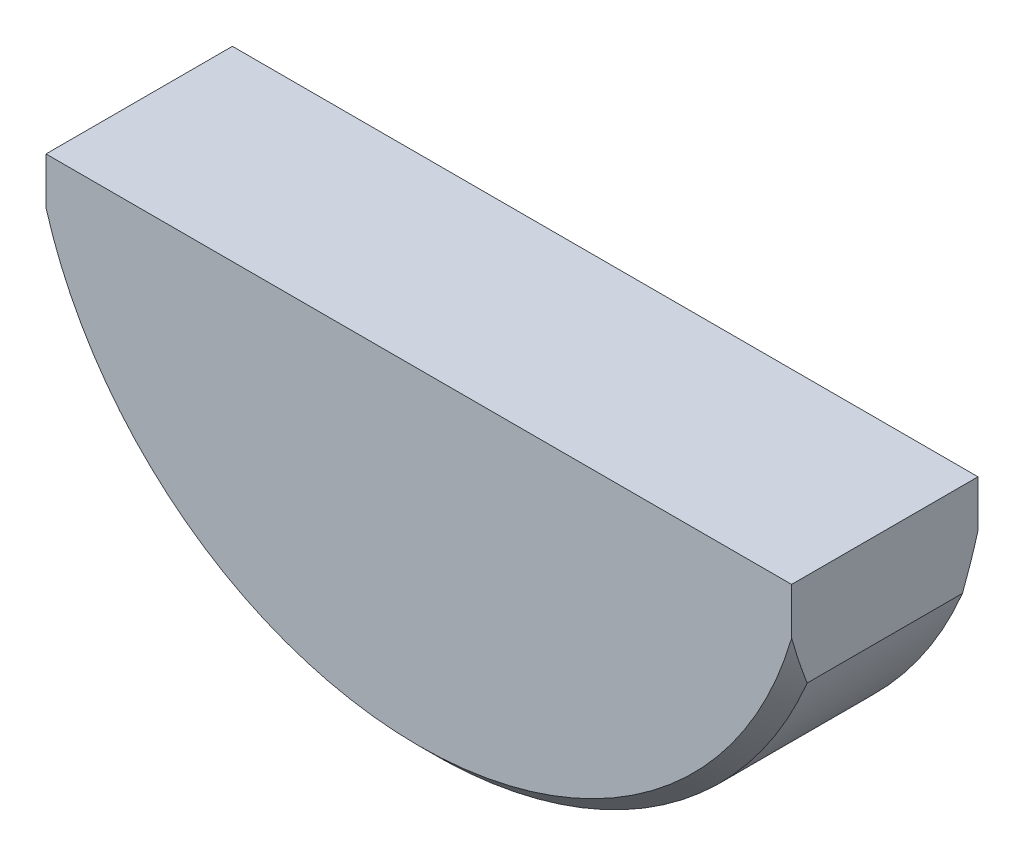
ISO-10303-21;
HEADER;
FILE_DESCRIPTION(('STEP AP214'),'2;1');
FILE_NAME('part.step','',(''),(''),'','','');
FILE_SCHEMA(('AUTOMOTIVE_DESIGN { 1 0 10303 214 1 1 1 1 }'));
ENDSEC;
DATA;
#1=APPLICATION_CONTEXT('core data for automotive mechanical design processes');
#2=APPLICATION_PROTOCOL_DEFINITION('international standard','automotive_design',2000,#1);
#3=PRODUCT_CONTEXT('',#1,'mechanical');
#4=PRODUCT('Part','Part','',(#3));
#5=PRODUCT_RELATED_PRODUCT_CATEGORY('part','',(#4));
#6=PRODUCT_DEFINITION_FORMATION('','',#4);
#7=PRODUCT_DEFINITION_CONTEXT('part definition',#1,'design');
#8=PRODUCT_DEFINITION('design','',#6,#7);
#9=PRODUCT_DEFINITION_SHAPE('','',#8);
#10=(LENGTH_UNIT() NAMED_UNIT(*) SI_UNIT(.MILLI.,.METRE.));
#11=(NAMED_UNIT(*) PLANE_ANGLE_UNIT() SI_UNIT($,.RADIAN.));
#12=(NAMED_UNIT(*) SI_UNIT($,.STERADIAN.) SOLID_ANGLE_UNIT());
#13=UNCERTAINTY_MEASURE_WITH_UNIT(LENGTH_MEASURE(1.E-05),#10,'distance_accuracy_value','');
#14=(GEOMETRIC_REPRESENTATION_CONTEXT(3) GLOBAL_UNCERTAINTY_ASSIGNED_CONTEXT((#13)) GLOBAL_UNIT_ASSIGNED_CONTEXT((#10,
#11,#12)) REPRESENTATION_CONTEXT('',''));
#15=CARTESIAN_POINT('',(0.,0.,0.));
#16=DIRECTION('',(0.,0.,1.));
#17=DIRECTION('',(1.,0.,0.));
#18=AXIS2_PLACEMENT_3D('',#15,#16,#17);
#19=CARTESIAN_POINT('',(0.,34.,6.00000000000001));
#20=DIRECTION('',(0.,0.,-1.));
#21=DIRECTION('',(-1.,0.,0.));
#22=AXIS2_PLACEMENT_3D('',#19,#20,#21);
#23=CYLINDRICAL_SURFACE('',#22,26.);
#24=DIRECTION('',(0.,0.,-1.));
#25=VECTOR('',#24,1.);
#26=CARTESIAN_POINT('',(24.,24.,6.00000000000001));
#27=LINE('',#26,#25);
#28=CARTESIAN_POINT('',(24.,24.,4.99999999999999));
#29=VERTEX_POINT('',#28);
#30=CARTESIAN_POINT('',(24.,24.,-4.99999999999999));
#31=VERTEX_POINT('',#30);
#32=EDGE_CURVE('E99',#29,#31,#27,.T.);
#33=ORIENTED_EDGE('',*,*,#32,.F.);
#34=CARTESIAN_POINT('',(0.,34.,4.99999999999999));
#35=DIRECTION('',(0.,0.,1.));
#36=DIRECTION('',(1.,0.,0.));
#37=AXIS2_PLACEMENT_3D('',#34,#35,#36);
#38=CIRCLE('',#37,26.);
#39=CARTESIAN_POINT('',(-24.,24.,4.99999999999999));
#40=VERTEX_POINT('',#39);
#41=EDGE_CURVE('E171',#29,#40,#38,.F.);
#42=ORIENTED_EDGE('',*,*,#41,.T.);
#43=DIRECTION('',(0.,0.,-1.));
#44=VECTOR('',#43,1.);
#45=CARTESIAN_POINT('',(-24.,24.,6.00000000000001));
#46=LINE('',#45,#44);
#47=CARTESIAN_POINT('',(-24.,24.,-4.99999999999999));
#48=VERTEX_POINT('',#47);
#49=EDGE_CURVE('E113',#40,#48,#46,.T.);
#50=ORIENTED_EDGE('',*,*,#49,.T.);
#51=CARTESIAN_POINT('',(0.,34.,-4.99999999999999));
#52=DIRECTION('',(0.,0.,1.));
#53=DIRECTION('',(1.,0.,0.));
#54=AXIS2_PLACEMENT_3D('',#51,#52,#53);
#55=CIRCLE('',#54,26.);
#56=EDGE_CURVE('E173',#48,#31,#55,.T.);
#57=ORIENTED_EDGE('',*,*,#56,.T.);
#58=EDGE_LOOP('',(#33,#42,#50,#57));
#59=FACE_BOUND('',#58,.T.);
#60=ADVANCED_FACE('F31',(#59),#23,.T.);
#61=CARTESIAN_POINT('',(24.,30.,6.00000000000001));
#62=DIRECTION('',(-1.,0.,0.));
#63=DIRECTION('',(0.,-1.,0.));
#64=AXIS2_PLACEMENT_3D('',#61,#62,#63);
#65=PLANE('',#64);
#66=DIRECTION('',(0.,1.,0.));
#67=VECTOR('',#66,1.);
#68=CARTESIAN_POINT('',(24.,30.,6.00000000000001));
#69=LINE('',#68,#67);
#70=CARTESIAN_POINT('',(24.,27.,6.00000000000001));
#71=VERTEX_POINT('',#70);
#72=CARTESIAN_POINT('',(24.,30.,6.00000000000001));
#73=VERTEX_POINT('',#72);
#74=EDGE_CURVE('E105',#71,#73,#69,.T.);
#75=ORIENTED_EDGE('',*,*,#74,.F.);
#76=CARTESIAN_POINT('',(24.,27.,6.00000000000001));
#77=CARTESIAN_POINT('',(24.,26.7460623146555,5.9288985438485));
#78=CARTESIAN_POINT('',(24.,26.4930594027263,5.85449089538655));
#79=CARTESIAN_POINT('',(24.,25.9891141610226,5.69946924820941));
#80=CARTESIAN_POINT('',(24.,25.7381707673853,5.61885871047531));
#81=CARTESIAN_POINT('',(24.,25.2382632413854,5.4517607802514));
#82=CARTESIAN_POINT('',(24.,24.9892990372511,5.36527360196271));
#83=CARTESIAN_POINT('',(24.,24.4932211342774,5.18672294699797));
#84=CARTESIAN_POINT('',(24.,24.246108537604,5.09465640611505));
#85=CARTESIAN_POINT('',(24.,24.,4.99999999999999));
#86=B_SPLINE_CURVE_WITH_KNOTS('',3,(#76,#77,#78,#79,#80,#81,#82,#83,#84,#85),.UNSPECIFIED.,.F.,
.F.,(4,2,2,2,4),(0.,0.791076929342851,1.58171562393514,2.37232551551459,3.16337361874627),.UNSPECIFIED.);
#87=EDGE_CURVE('E125',#71,#29,#86,.T.);
#88=ORIENTED_EDGE('',*,*,#87,.T.);
#89=ORIENTED_EDGE('',*,*,#32,.T.);
#90=CARTESIAN_POINT('',(24.,24.,-4.99999999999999));
#91=CARTESIAN_POINT('',(24.,24.246108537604,-5.09465640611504));
#92=CARTESIAN_POINT('',(24.,24.4932211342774,-5.18672294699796));
#93=CARTESIAN_POINT('',(24.,24.9892990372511,-5.36527360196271));
#94=CARTESIAN_POINT('',(24.,25.2382632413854,-5.45176078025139));
#95=CARTESIAN_POINT('',(24.,25.7381707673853,-5.6188587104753));
#96=CARTESIAN_POINT('',(24.,25.9891141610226,-5.6994692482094));
#97=CARTESIAN_POINT('',(24.,26.4930594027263,-5.85449089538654));
#98=CARTESIAN_POINT('',(24.,26.7460623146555,-5.92889854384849));
#99=CARTESIAN_POINT('',(24.,27.,-6.00000000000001));
#100=B_SPLINE_CURVE_WITH_KNOTS('',3,(#90,#91,#92,#93,#94,#95,#96,#97,#98,#99),.UNSPECIFIED.,.F.,
.F.,(4,2,2,2,4),(0.,0.791048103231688,1.58165799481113,2.37229668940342,3.16337361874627),.UNSPECIFIED.);
#101=CARTESIAN_POINT('',(24.,27.,-6.00000000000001));
#102=VERTEX_POINT('',#101);
#103=EDGE_CURVE('E90',#31,#102,#100,.T.);
#104=ORIENTED_EDGE('',*,*,#103,.T.);
#105=DIRECTION('',(0.,1.,0.));
#106=VECTOR('',#105,1.);
#107=CARTESIAN_POINT('',(24.,30.,-6.00000000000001));
#108=LINE('',#107,#106);
#109=CARTESIAN_POINT('',(24.,30.,-6.00000000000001));
#110=VERTEX_POINT('',#109);
#111=EDGE_CURVE('E83',#102,#110,#108,.T.);
#112=ORIENTED_EDGE('',*,*,#111,.T.);
#113=DIRECTION('',(0.,0.,-1.));
#114=VECTOR('',#113,1.);
#115=CARTESIAN_POINT('',(24.,30.,6.00000000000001));
#116=LINE('',#115,#114);
#117=EDGE_CURVE('E87',#73,#110,#116,.T.);
#118=ORIENTED_EDGE('',*,*,#117,.F.);
#119=EDGE_LOOP('',(#75,#88,#89,#104,#112,#118));
#120=FACE_BOUND('',#119,.T.);
#121=ADVANCED_FACE('F86',(#120),#65,.F.);
#122=CARTESIAN_POINT('',(-24.,30.,6.00000000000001));
#123=DIRECTION('',(0.,-1.,0.));
#124=DIRECTION('',(0.,0.,-1.));
#125=AXIS2_PLACEMENT_3D('',#122,#123,#124);
#126=PLANE('',#125);
#127=DIRECTION('',(-1.,0.,0.));
#128=VECTOR('',#127,1.);
#129=CARTESIAN_POINT('',(-24.,30.,-6.00000000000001));
#130=LINE('',#129,#128);
#131=CARTESIAN_POINT('',(-24.,30.,-6.00000000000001));
#132=VERTEX_POINT('',#131);
#133=EDGE_CURVE('E92',#110,#132,#130,.T.);
#134=ORIENTED_EDGE('',*,*,#133,.T.);
#135=DIRECTION('',(0.,0.,-1.));
#136=VECTOR('',#135,1.);
#137=CARTESIAN_POINT('',(-24.,30.,6.00000000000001));
#138=LINE('',#137,#136);
#139=CARTESIAN_POINT('',(-24.,30.,6.00000000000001));
#140=VERTEX_POINT('',#139);
#141=EDGE_CURVE('E100',#140,#132,#138,.T.);
#142=ORIENTED_EDGE('',*,*,#141,.F.);
#143=DIRECTION('',(-1.,0.,0.));
#144=VECTOR('',#143,1.);
#145=CARTESIAN_POINT('',(-24.,30.,6.00000000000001));
#146=LINE('',#145,#144);
#147=EDGE_CURVE('E98',#73,#140,#146,.T.);
#148=ORIENTED_EDGE('',*,*,#147,.F.);
#149=ORIENTED_EDGE('',*,*,#117,.T.);
#150=EDGE_LOOP('',(#134,#142,#148,#149));
#151=FACE_BOUND('',#150,.T.);
#152=ADVANCED_FACE('F95',(#151),#126,.F.);
#153=CARTESIAN_POINT('',(-24.,30.,6.00000000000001));
#154=DIRECTION('',(1.,0.,0.));
#155=DIRECTION('',(0.,0.,-1.));
#156=AXIS2_PLACEMENT_3D('',#153,#154,#155);
#157=PLANE('',#156);
#158=ORIENTED_EDGE('',*,*,#49,.F.);
#159=CARTESIAN_POINT('',(-24.,24.,4.99999999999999));
#160=CARTESIAN_POINT('',(-24.,24.246108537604,5.09465640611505));
#161=CARTESIAN_POINT('',(-24.,24.4932211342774,5.18672294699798));
#162=CARTESIAN_POINT('',(-24.,24.9892990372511,5.36527360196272));
#163=CARTESIAN_POINT('',(-24.,25.2382632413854,5.45176078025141));
#164=CARTESIAN_POINT('',(-24.,25.7381707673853,5.61885871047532));
#165=CARTESIAN_POINT('',(-24.,25.9891141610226,5.69946924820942));
#166=CARTESIAN_POINT('',(-24.,26.4930594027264,5.85449089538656));
#167=CARTESIAN_POINT('',(-24.,26.7460623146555,5.9288985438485));
#168=CARTESIAN_POINT('',(-24.,27.,6.00000000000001));
#169=B_SPLINE_CURVE_WITH_KNOTS('',3,(#159,#160,#161,#162,#163,#164,#165,#166,#167,#168),
.UNSPECIFIED.,.F.,.F.,(4,2,2,2,4),(0.,0.7910481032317,1.58165799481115,2.37229668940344,
3.1633736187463),.UNSPECIFIED.);
#170=CARTESIAN_POINT('',(-24.,27.,6.00000000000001));
#171=VERTEX_POINT('',#170);
#172=EDGE_CURVE('E38',#40,#171,#169,.T.);
#173=ORIENTED_EDGE('',*,*,#172,.T.);
#174=DIRECTION('',(0.,-1.,0.));
#175=VECTOR('',#174,1.);
#176=CARTESIAN_POINT('',(-24.,30.,6.00000000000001));
#177=LINE('',#176,#175);
#178=EDGE_CURVE('E110',#140,#171,#177,.T.);
#179=ORIENTED_EDGE('',*,*,#178,.F.);
#180=ORIENTED_EDGE('',*,*,#141,.T.);
#181=DIRECTION('',(0.,-1.,0.));
#182=VECTOR('',#181,1.);
#183=CARTESIAN_POINT('',(-24.,30.,-6.00000000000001));
#184=LINE('',#183,#182);
#185=CARTESIAN_POINT('',(-24.,27.,-6.00000000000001));
#186=VERTEX_POINT('',#185);
#187=EDGE_CURVE('E103',#132,#186,#184,.T.);
#188=ORIENTED_EDGE('',*,*,#187,.T.);
#189=CARTESIAN_POINT('',(-24.,27.,-6.00000000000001));
#190=CARTESIAN_POINT('',(-24.,26.7460623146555,-5.9288985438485));
#191=CARTESIAN_POINT('',(-24.,26.4930594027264,-5.85449089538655));
#192=CARTESIAN_POINT('',(-24.,25.9891141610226,-5.69946924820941));
#193=CARTESIAN_POINT('',(-24.,25.7381707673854,-5.61885871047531));
#194=CARTESIAN_POINT('',(-24.,25.2382632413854,-5.4517607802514));
#195=CARTESIAN_POINT('',(-24.,24.9892990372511,-5.36527360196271));
#196=CARTESIAN_POINT('',(-24.,24.4932211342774,-5.18672294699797));
#197=CARTESIAN_POINT('',(-24.,24.246108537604,-5.09465640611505));
#198=CARTESIAN_POINT('',(-24.,24.,-5.));
#199=B_SPLINE_CURVE_WITH_KNOTS('',3,(#189,#190,#191,#192,#193,#194,#195,#196,#197,#198),
.UNSPECIFIED.,.F.,.F.,(4,2,2,2,4),(0.,0.791076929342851,1.58171562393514,2.37232551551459,
3.16337361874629),.UNSPECIFIED.);
#200=EDGE_CURVE('E50',#186,#48,#199,.T.);
#201=ORIENTED_EDGE('',*,*,#200,.T.);
#202=EDGE_LOOP('',(#158,#173,#179,#180,#188,#201));
#203=FACE_BOUND('',#202,.T.);
#204=ADVANCED_FACE('F139',(#203),#157,.F.);
#205=CARTESIAN_POINT('',(0.,34.,6.00000000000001));
#206=DIRECTION('',(0.,0.,1.));
#207=DIRECTION('',(1.,0.,0.));
#208=AXIS2_PLACEMENT_3D('',#205,#206,#207);
#209=PLANE('',#208);
#210=ORIENTED_EDGE('',*,*,#178,.T.);
#211=CARTESIAN_POINT('',(0.,34.,6.00000000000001));
#212=DIRECTION('',(0.,0.,1.));
#213=DIRECTION('',(1.,0.,0.));
#214=AXIS2_PLACEMENT_3D('',#211,#212,#213);
#215=CIRCLE('',#214,25.);
#216=EDGE_CURVE('E117',#171,#71,#215,.T.);
#217=ORIENTED_EDGE('',*,*,#216,.T.);
#218=ORIENTED_EDGE('',*,*,#74,.T.);
#219=ORIENTED_EDGE('',*,*,#147,.T.);
#220=EDGE_LOOP('',(#210,#217,#218,#219));
#221=FACE_BOUND('',#220,.T.);
#222=ADVANCED_FACE('F143',(#221),#209,.T.);
#223=CARTESIAN_POINT('',(0.,34.,-6.00000000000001));
#224=DIRECTION('',(0.,0.,1.));
#225=DIRECTION('',(1.,0.,0.));
#226=AXIS2_PLACEMENT_3D('',#223,#224,#225);
#227=PLANE('',#226);
#228=ORIENTED_EDGE('',*,*,#111,.F.);
#229=CARTESIAN_POINT('',(0.,34.,-6.00000000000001));
#230=DIRECTION('',(0.,0.,1.));
#231=DIRECTION('',(1.,0.,0.));
#232=AXIS2_PLACEMENT_3D('',#229,#230,#231);
#233=CIRCLE('',#232,25.);
#234=EDGE_CURVE('E11',#102,#186,#233,.F.);
#235=ORIENTED_EDGE('',*,*,#234,.T.);
#236=ORIENTED_EDGE('',*,*,#187,.F.);
#237=ORIENTED_EDGE('',*,*,#133,.F.);
#238=EDGE_LOOP('',(#228,#235,#236,#237));
#239=FACE_BOUND('',#238,.T.);
#240=ADVANCED_FACE('F102',(#239),#227,.F.);
#241=CARTESIAN_POINT('',(0.,34.,6.00000000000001));
#242=DIRECTION('',(0.,0.,-1.));
#243=DIRECTION('',(-1.,0.,0.));
#244=AXIS2_PLACEMENT_3D('',#241,#242,#243);
#245=CONICAL_SURFACE('',#244,25.,0.785398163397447);
#246=ORIENTED_EDGE('',*,*,#172,.F.);
#247=ORIENTED_EDGE('',*,*,#41,.F.);
#248=ORIENTED_EDGE('',*,*,#87,.F.);
#249=ORIENTED_EDGE('',*,*,#216,.F.);
#250=EDGE_LOOP('',(#246,#247,#248,#249));
#251=FACE_BOUND('',#250,.T.);
#252=ADVANCED_FACE('F154',(#251),#245,.T.);
#253=CARTESIAN_POINT('',(0.,34.,-4.99999999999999));
#254=DIRECTION('',(0.,0.,1.));
#255=DIRECTION('',(1.,0.,0.));
#256=AXIS2_PLACEMENT_3D('',#253,#254,#255);
#257=CONICAL_SURFACE('',#256,26.,0.785398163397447);
#258=ORIENTED_EDGE('',*,*,#200,.F.);
#259=ORIENTED_EDGE('',*,*,#234,.F.);
#260=ORIENTED_EDGE('',*,*,#103,.F.);
#261=ORIENTED_EDGE('',*,*,#56,.F.);
#262=EDGE_LOOP('',(#258,#259,#260,#261));
#263=FACE_BOUND('',#262,.T.);
#264=ADVANCED_FACE('F131',(#263),#257,.T.);
#265=CLOSED_SHELL('',(#60,#121,#152,#204,#222,#240,#252,#264));
#266=MANIFOLD_SOLID_BREP('B2',#265);
#267=ADVANCED_BREP_SHAPE_REPRESENTATION('',(#18,#266),#14);
#268=SHAPE_DEFINITION_REPRESENTATION(#9,#267);
ENDSEC;
END-ISO-10303-21;
